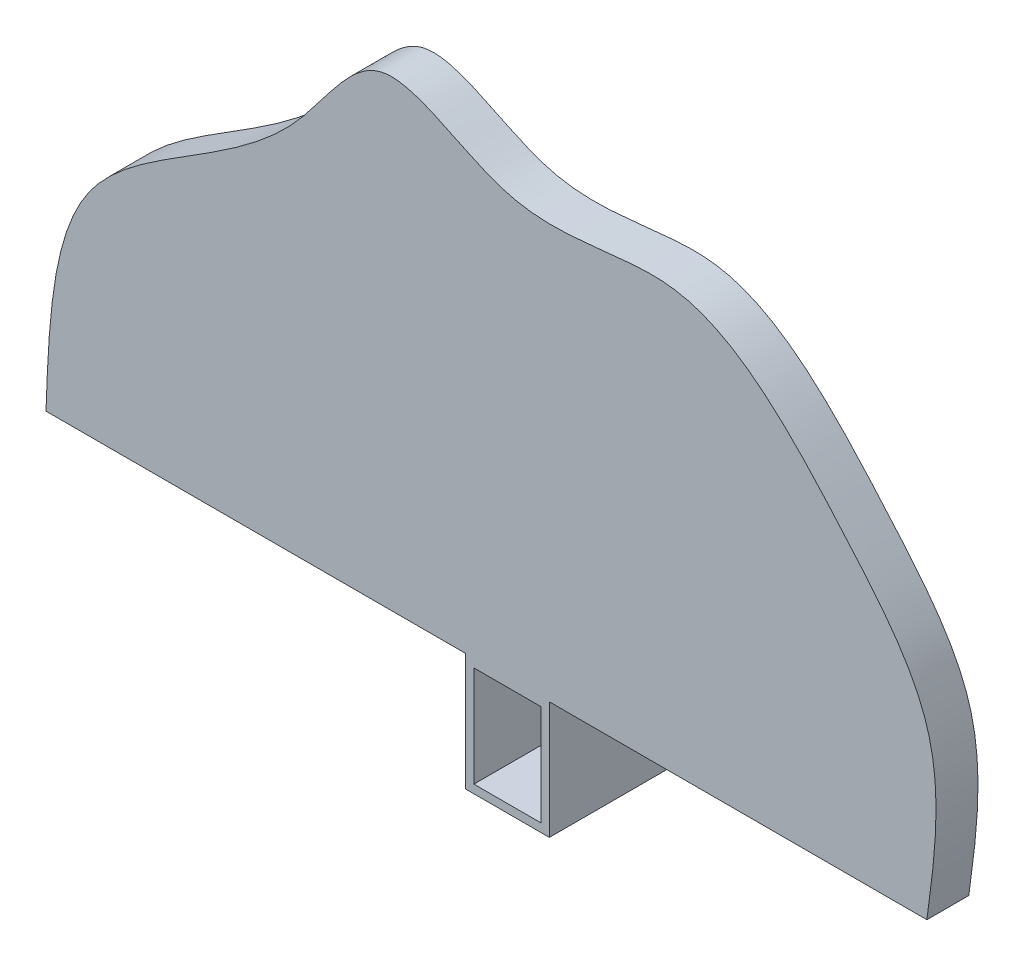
ISO-10303-21;
HEADER;
FILE_DESCRIPTION(('STEP AP214'),'2;1');
FILE_NAME('part.step','',(''),(''),'','','');
FILE_SCHEMA(('AUTOMOTIVE_DESIGN { 1 0 10303 214 1 1 1 1 }'));
ENDSEC;
DATA;
#1=APPLICATION_CONTEXT('core data for automotive mechanical design processes');
#2=APPLICATION_PROTOCOL_DEFINITION('international standard','automotive_design',2000,#1);
#3=PRODUCT_CONTEXT('',#1,'mechanical');
#4=PRODUCT('Part','Part','',(#3));
#5=PRODUCT_RELATED_PRODUCT_CATEGORY('part','',(#4));
#6=PRODUCT_DEFINITION_FORMATION('','',#4);
#7=PRODUCT_DEFINITION_CONTEXT('part definition',#1,'design');
#8=PRODUCT_DEFINITION('design','',#6,#7);
#9=PRODUCT_DEFINITION_SHAPE('','',#8);
#10=(LENGTH_UNIT() NAMED_UNIT(*) SI_UNIT(.MILLI.,.METRE.));
#11=(NAMED_UNIT(*) PLANE_ANGLE_UNIT() SI_UNIT($,.RADIAN.));
#12=(NAMED_UNIT(*) SI_UNIT($,.STERADIAN.) SOLID_ANGLE_UNIT());
#13=UNCERTAINTY_MEASURE_WITH_UNIT(LENGTH_MEASURE(1.E-05),#10,'distance_accuracy_value','');
#14=(GEOMETRIC_REPRESENTATION_CONTEXT(3) GLOBAL_UNCERTAINTY_ASSIGNED_CONTEXT((#13)) GLOBAL_UNIT_ASSIGNED_CONTEXT((#10,
#11,#12)) REPRESENTATION_CONTEXT('',''));
#15=CARTESIAN_POINT('',(0.,0.,0.));
#16=DIRECTION('',(0.,0.,1.));
#17=DIRECTION('',(1.,0.,0.));
#18=AXIS2_PLACEMENT_3D('',#15,#16,#17);
#19=CARTESIAN_POINT('',(-110.,0.,-10.));
#20=DIRECTION('',(0.,-1.,0.));
#21=DIRECTION('',(0.,0.,-1.));
#22=AXIS2_PLACEMENT_3D('',#19,#20,#21);
#23=PLANE('',#22);
#24=DIRECTION('',(0.,0.,1.));
#25=VECTOR('',#24,1.);
#26=CARTESIAN_POINT('',(-9.99999999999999,0.,-40.));
#27=LINE('',#26,#25);
#28=CARTESIAN_POINT('',(-9.99999999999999,0.,-10.));
#29=VERTEX_POINT('',#28);
#30=CARTESIAN_POINT('',(-9.99999999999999,0.,0.));
#31=VERTEX_POINT('',#30);
#32=EDGE_CURVE('E501',#29,#31,#27,.T.);
#33=ORIENTED_EDGE('',*,*,#32,.T.);
#34=DIRECTION('',(1.,0.,0.));
#35=VECTOR('',#34,1.);
#36=CARTESIAN_POINT('',(-110.,0.,0.));
#37=LINE('',#36,#35);
#38=CARTESIAN_POINT('',(-110.,0.,0.));
#39=VERTEX_POINT('',#38);
#40=EDGE_CURVE('E517',#39,#31,#37,.T.);
#41=ORIENTED_EDGE('',*,*,#40,.F.);
#42=DIRECTION('',(0.,0.,1.));
#43=VECTOR('',#42,1.);
#44=CARTESIAN_POINT('',(-110.,0.,-10.));
#45=LINE('',#44,#43);
#46=CARTESIAN_POINT('',(-110.,0.,-10.));
#47=VERTEX_POINT('',#46);
#48=EDGE_CURVE('E355',#47,#39,#45,.T.);
#49=ORIENTED_EDGE('',*,*,#48,.F.);
#50=DIRECTION('',(1.,0.,0.));
#51=VECTOR('',#50,1.);
#52=CARTESIAN_POINT('',(-110.,0.,-10.));
#53=LINE('',#52,#51);
#54=EDGE_CURVE('E528',#47,#29,#53,.T.);
#55=ORIENTED_EDGE('',*,*,#54,.T.);
#56=EDGE_LOOP('',(#33,#41,#49,#55));
#57=FACE_BOUND('',#56,.T.);
#58=ADVANCED_FACE('F350',(#57),#23,.T.);
#59=CARTESIAN_POINT('',(100.,0.,-10.));
#60=CARTESIAN_POINT('',(101.896739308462,13.9560397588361,-10.));
#61=CARTESIAN_POINT('',(105.503176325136,40.4918837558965,-10.));
#62=CARTESIAN_POINT('',(77.3846924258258,73.2789872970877,-10.));
#63=CARTESIAN_POINT('',(45.1339616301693,108.969797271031,-10.));
#64=CARTESIAN_POINT('',(2.74067492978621,91.7351342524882,-10.));
#65=CARTESIAN_POINT('',(-31.2813253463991,119.849398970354,-10.));
#66=CARTESIAN_POINT('',(-55.5321833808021,74.6212133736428,-10.));
#67=CARTESIAN_POINT('',(-107.755610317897,60.9190236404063,-10.));
#68=CARTESIAN_POINT('',(-109.310639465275,18.7111761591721,-10.));
#69=CARTESIAN_POINT('',(-110.,0.,-10.));
#70=B_SPLINE_CURVE_WITH_KNOTS('',3,(#59,#60,#61,#62,#63,#64,#65,#66,#67,#68,#69),.UNSPECIFIED.,
.F.,.F.,(4,1,1,1,1,1,1,1,4),(0.,0.117307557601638,0.223047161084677,0.369681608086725,
0.486989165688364,0.579728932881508,0.662677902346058,0.850461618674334,1.),.UNSPECIFIED.);
#71=DIRECTION('',(0.,0.,1.));
#72=VECTOR('',#71,1.);
#73=SURFACE_OF_LINEAR_EXTRUSION('',#70,#72);
#74=CARTESIAN_POINT('',(100.,0.,0.));
#75=CARTESIAN_POINT('',(101.896739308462,13.9560397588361,0.));
#76=CARTESIAN_POINT('',(105.503176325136,40.4918837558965,0.));
#77=CARTESIAN_POINT('',(77.3846924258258,73.2789872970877,0.));
#78=CARTESIAN_POINT('',(45.1339616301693,108.969797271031,0.));
#79=CARTESIAN_POINT('',(2.74067492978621,91.7351342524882,0.));
#80=CARTESIAN_POINT('',(-31.2813253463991,119.849398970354,0.));
#81=CARTESIAN_POINT('',(-55.5321833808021,74.6212133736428,0.));
#82=CARTESIAN_POINT('',(-107.755610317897,60.9190236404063,0.));
#83=CARTESIAN_POINT('',(-109.310639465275,18.7111761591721,0.));
#84=CARTESIAN_POINT('',(-110.,0.,0.));
#85=B_SPLINE_CURVE_WITH_KNOTS('',3,(#74,#75,#76,#77,#78,#79,#80,#81,#82,#83,#84),.UNSPECIFIED.,
.F.,.F.,(4,1,1,1,1,1,1,1,4),(0.,0.117307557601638,0.223047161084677,0.369681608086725,
0.486989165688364,0.579728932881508,0.662677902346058,0.850461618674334,1.),.UNSPECIFIED.);
#86=CARTESIAN_POINT('',(100.,0.,0.));
#87=VERTEX_POINT('',#86);
#88=EDGE_CURVE('E511',#87,#39,#85,.T.);
#89=ORIENTED_EDGE('',*,*,#88,.F.);
#90=DIRECTION('',(0.,0.,1.));
#91=VECTOR('',#90,1.);
#92=CARTESIAN_POINT('',(100.,0.,-10.));
#93=LINE('',#92,#91);
#94=CARTESIAN_POINT('',(100.,0.,-10.));
#95=VERTEX_POINT('',#94);
#96=EDGE_CURVE('E11',#95,#87,#93,.T.);
#97=ORIENTED_EDGE('',*,*,#96,.F.);
#98=EDGE_CURVE('E522',#95,#47,#70,.T.);
#99=ORIENTED_EDGE('',*,*,#98,.T.);
#100=ORIENTED_EDGE('',*,*,#48,.T.);
#101=EDGE_LOOP('',(#89,#97,#99,#100));
#102=FACE_BOUND('',#101,.T.);
#103=ADVANCED_FACE('F352',(#102),#73,.T.);
#104=DIRECTION('',(0.,0.,1.));
#105=VECTOR('',#104,1.);
#106=CARTESIAN_POINT('',(10.,0.,-40.));
#107=LINE('',#106,#105);
#108=CARTESIAN_POINT('',(10.,0.,-10.));
#109=VERTEX_POINT('',#108);
#110=CARTESIAN_POINT('',(10.,0.,0.));
#111=VERTEX_POINT('',#110);
#112=EDGE_CURVE('E505',#109,#111,#107,.T.);
#113=ORIENTED_EDGE('',*,*,#112,.F.);
#114=EDGE_CURVE('E373',#109,#95,#53,.T.);
#115=ORIENTED_EDGE('',*,*,#114,.T.);
#116=ORIENTED_EDGE('',*,*,#96,.T.);
#117=EDGE_CURVE('E516',#111,#87,#37,.T.);
#118=ORIENTED_EDGE('',*,*,#117,.F.);
#119=EDGE_LOOP('',(#113,#115,#116,#118));
#120=FACE_BOUND('',#119,.T.);
#121=ADVANCED_FACE('F550',(#120),#23,.T.);
#122=CARTESIAN_POINT('',(-4.56654199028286,101.561702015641,-10.));
#123=DIRECTION('',(0.,0.,1.));
#124=DIRECTION('',(1.,0.,0.));
#125=AXIS2_PLACEMENT_3D('',#122,#123,#124);
#126=PLANE('',#125);
#127=ORIENTED_EDGE('',*,*,#98,.F.);
#128=ORIENTED_EDGE('',*,*,#114,.F.);
#129=DIRECTION('',(-1.,0.,0.));
#130=VECTOR('',#129,1.);
#131=CARTESIAN_POINT('',(-4.56654199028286,0.,-10.));
#132=LINE('',#131,#130);
#133=EDGE_CURVE('E500',#109,#29,#132,.T.);
#134=ORIENTED_EDGE('',*,*,#133,.T.);
#135=ORIENTED_EDGE('',*,*,#54,.F.);
#136=EDGE_LOOP('',(#127,#128,#134,#135));
#137=FACE_BOUND('',#136,.T.);
#138=ADVANCED_FACE('F548',(#137),#126,.F.);
#139=CARTESIAN_POINT('',(-4.56654199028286,101.561702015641,0.));
#140=DIRECTION('',(0.,0.,1.));
#141=DIRECTION('',(1.,0.,0.));
#142=AXIS2_PLACEMENT_3D('',#139,#140,#141);
#143=PLANE('',#142);
#144=ORIENTED_EDGE('',*,*,#88,.T.);
#145=ORIENTED_EDGE('',*,*,#40,.T.);
#146=DIRECTION('',(0.,-1.,0.));
#147=VECTOR('',#146,1.);
#148=CARTESIAN_POINT('',(-9.99999999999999,0.,0.));
#149=LINE('',#148,#147);
#150=CARTESIAN_POINT('',(-10.,-28.,0.));
#151=VERTEX_POINT('',#150);
#152=EDGE_CURVE('E476',#31,#151,#149,.T.);
#153=ORIENTED_EDGE('',*,*,#152,.T.);
#154=DIRECTION('',(1.,0.,0.));
#155=VECTOR('',#154,1.);
#156=CARTESIAN_POINT('',(-10.,-28.,0.));
#157=LINE('',#156,#155);
#158=CARTESIAN_POINT('',(10.,-28.,0.));
#159=VERTEX_POINT('',#158);
#160=EDGE_CURVE('E481',#151,#159,#157,.T.);
#161=ORIENTED_EDGE('',*,*,#160,.T.);
#162=DIRECTION('',(0.,1.,0.));
#163=VECTOR('',#162,1.);
#164=CARTESIAN_POINT('',(10.,0.,0.));
#165=LINE('',#164,#163);
#166=EDGE_CURVE('E366',#159,#111,#165,.T.);
#167=ORIENTED_EDGE('',*,*,#166,.T.);
#168=ORIENTED_EDGE('',*,*,#117,.T.);
#169=EDGE_LOOP('',(#144,#145,#153,#161,#167,#168));
#170=FACE_BOUND('',#169,.T.);
#171=DIRECTION('',(0.,1.,0.));
#172=VECTOR('',#171,1.);
#173=CARTESIAN_POINT('',(8.,-2.,0.));
#174=LINE('',#173,#172);
#175=CARTESIAN_POINT('',(8.,-26.,0.));
#176=VERTEX_POINT('',#175);
#177=CARTESIAN_POINT('',(8.,-2.,0.));
#178=VERTEX_POINT('',#177);
#179=EDGE_CURVE('E456',#176,#178,#174,.T.);
#180=ORIENTED_EDGE('',*,*,#179,.F.);
#181=DIRECTION('',(1.,0.,0.));
#182=VECTOR('',#181,1.);
#183=CARTESIAN_POINT('',(-8.,-26.,0.));
#184=LINE('',#183,#182);
#185=CARTESIAN_POINT('',(-8.,-26.,0.));
#186=VERTEX_POINT('',#185);
#187=EDGE_CURVE('E460',#186,#176,#184,.T.);
#188=ORIENTED_EDGE('',*,*,#187,.F.);
#189=DIRECTION('',(0.,-1.,0.));
#190=VECTOR('',#189,1.);
#191=CARTESIAN_POINT('',(-8.,-2.,0.));
#192=LINE('',#191,#190);
#193=CARTESIAN_POINT('',(-8.,-2.,0.));
#194=VERTEX_POINT('',#193);
#195=EDGE_CURVE('E440',#194,#186,#192,.T.);
#196=ORIENTED_EDGE('',*,*,#195,.F.);
#197=DIRECTION('',(-1.,0.,0.));
#198=VECTOR('',#197,1.);
#199=CARTESIAN_POINT('',(-8.,-2.,0.));
#200=LINE('',#199,#198);
#201=EDGE_CURVE('E452',#178,#194,#200,.T.);
#202=ORIENTED_EDGE('',*,*,#201,.F.);
#203=EDGE_LOOP('',(#180,#188,#196,#202));
#204=FACE_BOUND('',#203,.T.);
#205=ADVANCED_FACE('F458',(#170,#204),#143,.T.);
#206=CARTESIAN_POINT('',(-9.99999999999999,0.,-40.));
#207=DIRECTION('',(0.,1.,0.));
#208=DIRECTION('',(-1.,0.,0.));
#209=AXIS2_PLACEMENT_3D('',#206,#207,#208);
#210=PLANE('',#209);
#211=ORIENTED_EDGE('',*,*,#133,.F.);
#212=CARTESIAN_POINT('',(10.,0.,-40.));
#213=VERTEX_POINT('',#212);
#214=EDGE_CURVE('E502',#213,#109,#107,.T.);
#215=ORIENTED_EDGE('',*,*,#214,.F.);
#216=DIRECTION('',(-1.,0.,0.));
#217=VECTOR('',#216,1.);
#218=CARTESIAN_POINT('',(-9.99999999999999,0.,-40.));
#219=LINE('',#218,#217);
#220=CARTESIAN_POINT('',(-9.99999999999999,0.,-40.));
#221=VERTEX_POINT('',#220);
#222=EDGE_CURVE('E493',#213,#221,#219,.T.);
#223=ORIENTED_EDGE('',*,*,#222,.T.);
#224=EDGE_CURVE('E497',#221,#29,#27,.T.);
#225=ORIENTED_EDGE('',*,*,#224,.T.);
#226=EDGE_LOOP('',(#211,#215,#223,#225));
#227=FACE_BOUND('',#226,.T.);
#228=ADVANCED_FACE('F545',(#227),#210,.T.);
#229=CARTESIAN_POINT('',(-9.99999999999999,0.,-40.));
#230=DIRECTION('',(-1.,0.,0.));
#231=DIRECTION('',(0.,-1.,0.));
#232=AXIS2_PLACEMENT_3D('',#229,#230,#231);
#233=PLANE('',#232);
#234=ORIENTED_EDGE('',*,*,#152,.F.);
#235=ORIENTED_EDGE('',*,*,#32,.F.);
#236=ORIENTED_EDGE('',*,*,#224,.F.);
#237=DIRECTION('',(0.,-1.,0.));
#238=VECTOR('',#237,1.);
#239=CARTESIAN_POINT('',(-9.99999999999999,0.,-40.));
#240=LINE('',#239,#238);
#241=CARTESIAN_POINT('',(-10.,-28.,-40.));
#242=VERTEX_POINT('',#241);
#243=EDGE_CURVE('E484',#221,#242,#240,.T.);
#244=ORIENTED_EDGE('',*,*,#243,.T.);
#245=DIRECTION('',(0.,0.,1.));
#246=VECTOR('',#245,1.);
#247=CARTESIAN_POINT('',(-10.,-28.,-40.));
#248=LINE('',#247,#246);
#249=EDGE_CURVE('E496',#242,#151,#248,.T.);
#250=ORIENTED_EDGE('',*,*,#249,.T.);
#251=EDGE_LOOP('',(#234,#235,#236,#244,#250));
#252=FACE_BOUND('',#251,.T.);
#253=ADVANCED_FACE('F542',(#252),#233,.T.);
#254=CARTESIAN_POINT('',(10.,0.,-40.));
#255=DIRECTION('',(1.,0.,0.));
#256=DIRECTION('',(0.,1.,0.));
#257=AXIS2_PLACEMENT_3D('',#254,#255,#256);
#258=PLANE('',#257);
#259=ORIENTED_EDGE('',*,*,#166,.F.);
#260=DIRECTION('',(0.,0.,1.));
#261=VECTOR('',#260,1.);
#262=CARTESIAN_POINT('',(10.,-28.,-40.));
#263=LINE('',#262,#261);
#264=CARTESIAN_POINT('',(10.,-28.,-40.));
#265=VERTEX_POINT('',#264);
#266=EDGE_CURVE('E506',#265,#159,#263,.T.);
#267=ORIENTED_EDGE('',*,*,#266,.F.);
#268=DIRECTION('',(0.,1.,0.));
#269=VECTOR('',#268,1.);
#270=CARTESIAN_POINT('',(10.,0.,-40.));
#271=LINE('',#270,#269);
#272=EDGE_CURVE('E490',#265,#213,#271,.T.);
#273=ORIENTED_EDGE('',*,*,#272,.T.);
#274=ORIENTED_EDGE('',*,*,#214,.T.);
#275=ORIENTED_EDGE('',*,*,#112,.T.);
#276=EDGE_LOOP('',(#259,#267,#273,#274,#275));
#277=FACE_BOUND('',#276,.T.);
#278=ADVANCED_FACE('F578',(#277),#258,.T.);
#279=CARTESIAN_POINT('',(-10.,-28.,-40.));
#280=DIRECTION('',(0.,-1.,0.));
#281=DIRECTION('',(0.,0.,-1.));
#282=AXIS2_PLACEMENT_3D('',#279,#280,#281);
#283=PLANE('',#282);
#284=ORIENTED_EDGE('',*,*,#160,.F.);
#285=ORIENTED_EDGE('',*,*,#249,.F.);
#286=DIRECTION('',(1.,0.,0.));
#287=VECTOR('',#286,1.);
#288=CARTESIAN_POINT('',(-10.,-28.,-40.));
#289=LINE('',#288,#287);
#290=EDGE_CURVE('E487',#242,#265,#289,.T.);
#291=ORIENTED_EDGE('',*,*,#290,.T.);
#292=ORIENTED_EDGE('',*,*,#266,.T.);
#293=EDGE_LOOP('',(#284,#285,#291,#292));
#294=FACE_BOUND('',#293,.T.);
#295=ADVANCED_FACE('F583',(#294),#283,.T.);
#296=CARTESIAN_POINT('',(-9.99999999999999,0.,-40.));
#297=DIRECTION('',(0.,0.,1.));
#298=DIRECTION('',(1.,0.,0.));
#299=AXIS2_PLACEMENT_3D('',#296,#297,#298);
#300=PLANE('',#299);
#301=DIRECTION('',(1.,0.,0.));
#302=VECTOR('',#301,1.);
#303=CARTESIAN_POINT('',(-8.,-26.,-40.));
#304=LINE('',#303,#302);
#305=CARTESIAN_POINT('',(-8.,-26.,-40.));
#306=VERTEX_POINT('',#305);
#307=CARTESIAN_POINT('',(8.,-26.,-40.));
#308=VERTEX_POINT('',#307);
#309=EDGE_CURVE('E471',#306,#308,#304,.T.);
#310=ORIENTED_EDGE('',*,*,#309,.T.);
#311=DIRECTION('',(0.,1.,0.));
#312=VECTOR('',#311,1.);
#313=CARTESIAN_POINT('',(8.,-2.,-40.));
#314=LINE('',#313,#312);
#315=CARTESIAN_POINT('',(8.,-2.,-40.));
#316=VERTEX_POINT('',#315);
#317=EDGE_CURVE('E462',#308,#316,#314,.T.);
#318=ORIENTED_EDGE('',*,*,#317,.T.);
#319=DIRECTION('',(-1.,0.,0.));
#320=VECTOR('',#319,1.);
#321=CARTESIAN_POINT('',(-8.,-2.,-40.));
#322=LINE('',#321,#320);
#323=CARTESIAN_POINT('',(-8.,-2.,-40.));
#324=VERTEX_POINT('',#323);
#325=EDGE_CURVE('E468',#316,#324,#322,.T.);
#326=ORIENTED_EDGE('',*,*,#325,.T.);
#327=DIRECTION('',(0.,-1.,0.));
#328=VECTOR('',#327,1.);
#329=CARTESIAN_POINT('',(-8.,-2.,-40.));
#330=LINE('',#329,#328);
#331=EDGE_CURVE('E443',#324,#306,#330,.T.);
#332=ORIENTED_EDGE('',*,*,#331,.T.);
#333=EDGE_LOOP('',(#310,#318,#326,#332));
#334=FACE_BOUND('',#333,.T.);
#335=ORIENTED_EDGE('',*,*,#243,.F.);
#336=ORIENTED_EDGE('',*,*,#222,.F.);
#337=ORIENTED_EDGE('',*,*,#272,.F.);
#338=ORIENTED_EDGE('',*,*,#290,.F.);
#339=EDGE_LOOP('',(#335,#336,#337,#338));
#340=FACE_BOUND('',#339,.T.);
#341=ADVANCED_FACE('F589',(#334,#340),#300,.F.);
#342=CARTESIAN_POINT('',(8.,-2.,-40.));
#343=DIRECTION('',(1.,0.,0.));
#344=DIRECTION('',(0.,1.,0.));
#345=AXIS2_PLACEMENT_3D('',#342,#343,#344);
#346=PLANE('',#345);
#347=ORIENTED_EDGE('',*,*,#179,.T.);
#348=DIRECTION('',(0.,0.,1.));
#349=VECTOR('',#348,1.);
#350=CARTESIAN_POINT('',(8.,-2.,-40.));
#351=LINE('',#350,#349);
#352=EDGE_CURVE('E448',#316,#178,#351,.T.);
#353=ORIENTED_EDGE('',*,*,#352,.F.);
#354=ORIENTED_EDGE('',*,*,#317,.F.);
#355=DIRECTION('',(0.,0.,1.));
#356=VECTOR('',#355,1.);
#357=CARTESIAN_POINT('',(8.,-26.,-40.));
#358=LINE('',#357,#356);
#359=EDGE_CURVE('E474',#308,#176,#358,.T.);
#360=ORIENTED_EDGE('',*,*,#359,.T.);
#361=EDGE_LOOP('',(#347,#353,#354,#360));
#362=FACE_BOUND('',#361,.T.);
#363=ADVANCED_FACE('F595',(#362),#346,.F.);
#364=CARTESIAN_POINT('',(-8.,-26.,-40.));
#365=DIRECTION('',(0.,-1.,0.));
#366=DIRECTION('',(0.,0.,-1.));
#367=AXIS2_PLACEMENT_3D('',#364,#365,#366);
#368=PLANE('',#367);
#369=ORIENTED_EDGE('',*,*,#187,.T.);
#370=ORIENTED_EDGE('',*,*,#359,.F.);
#371=ORIENTED_EDGE('',*,*,#309,.F.);
#372=DIRECTION('',(0.,0.,1.));
#373=VECTOR('',#372,1.);
#374=CARTESIAN_POINT('',(-8.,-26.,-40.));
#375=LINE('',#374,#373);
#376=EDGE_CURVE('E447',#306,#186,#375,.T.);
#377=ORIENTED_EDGE('',*,*,#376,.T.);
#378=EDGE_LOOP('',(#369,#370,#371,#377));
#379=FACE_BOUND('',#378,.T.);
#380=ADVANCED_FACE('F601',(#379),#368,.F.);
#381=CARTESIAN_POINT('',(-8.,-2.,-40.));
#382=DIRECTION('',(-1.,0.,0.));
#383=DIRECTION('',(0.,-1.,0.));
#384=AXIS2_PLACEMENT_3D('',#381,#382,#383);
#385=PLANE('',#384);
#386=ORIENTED_EDGE('',*,*,#195,.T.);
#387=ORIENTED_EDGE('',*,*,#376,.F.);
#388=ORIENTED_EDGE('',*,*,#331,.F.);
#389=DIRECTION('',(0.,0.,1.));
#390=VECTOR('',#389,1.);
#391=CARTESIAN_POINT('',(-8.,-2.,-40.));
#392=LINE('',#391,#390);
#393=EDGE_CURVE('E436',#324,#194,#392,.T.);
#394=ORIENTED_EDGE('',*,*,#393,.T.);
#395=EDGE_LOOP('',(#386,#387,#388,#394));
#396=FACE_BOUND('',#395,.T.);
#397=ADVANCED_FACE('F438',(#396),#385,.F.);
#398=CARTESIAN_POINT('',(-8.,-2.,-40.));
#399=DIRECTION('',(0.,1.,0.));
#400=DIRECTION('',(0.,0.,1.));
#401=AXIS2_PLACEMENT_3D('',#398,#399,#400);
#402=PLANE('',#401);
#403=ORIENTED_EDGE('',*,*,#201,.T.);
#404=ORIENTED_EDGE('',*,*,#393,.F.);
#405=ORIENTED_EDGE('',*,*,#325,.F.);
#406=ORIENTED_EDGE('',*,*,#352,.T.);
#407=EDGE_LOOP('',(#403,#404,#405,#406));
#408=FACE_BOUND('',#407,.T.);
#409=ADVANCED_FACE('F453',(#408),#402,.F.);
#410=CLOSED_SHELL('',(#58,#103,#121,#138,#205,#228,#253,#278,#295,#341,#363,#380,#397,#409));
#411=MANIFOLD_SOLID_BREP('B2',#410);
#412=ADVANCED_BREP_SHAPE_REPRESENTATION('',(#18,#411),#14);
#413=SHAPE_DEFINITION_REPRESENTATION(#9,#412);
ENDSEC;
END-ISO-10303-21;
